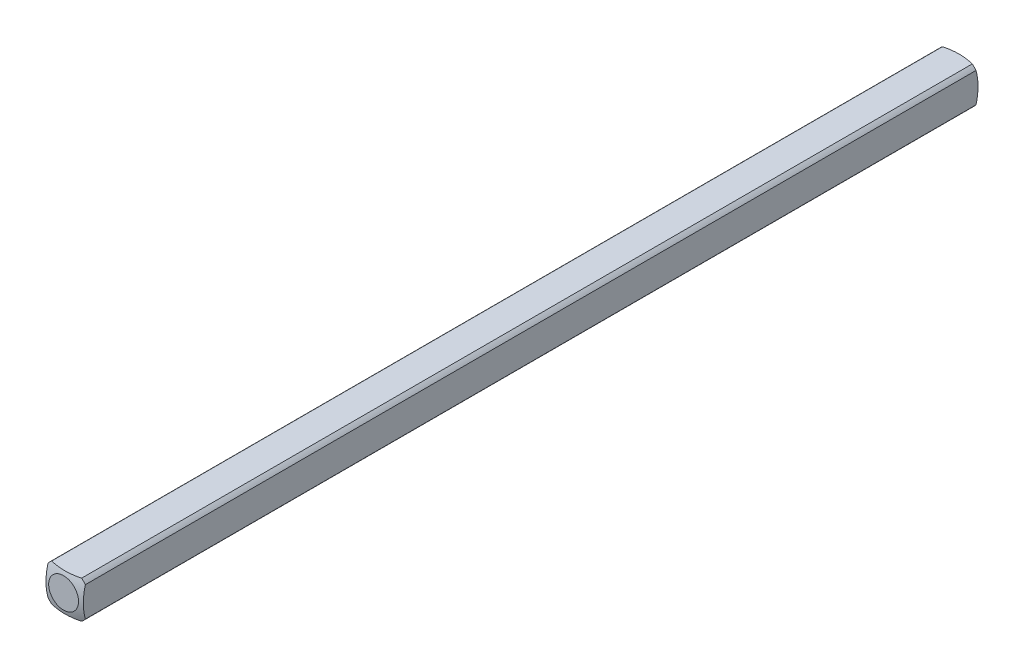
from build123d import *

# Parameters (mm, degrees)
SKETCH1_W           = 3.175
SKETCH1_H           = 3.175
BOSS_EXTRUDE1_DEPTH = 38.1
SKETCH2_OUTSIDE_W   = 12.848
SKETCH2_OUTSIDE_H   = 12.847
SKETCH2_OUTSIDE_R   = 2.032
CUT_EXTRUDE1_DEPTH  = 39.166088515


with BuildPart() as part:
    # Sketch1 → Boss-Extrude1 (new body)
    with BuildSketch(Plane.XY):
        Rectangle(SKETCH1_W, SKETCH1_H)
    extrude(amount=BOSS_EXTRUDE1_DEPTH)

    # Sketch2 outside → Cut-Extrude1 (cut, through all)
    with BuildSketch(Plane(origin=(0, 0, 0), x_dir=(-1, 0, 0), z_dir=(0, 0, -1))):
        with Locations((0, -0.0005)):
            Rectangle(SKETCH2_OUTSIDE_W, SKETCH2_OUTSIDE_H)
        Circle(SKETCH2_OUTSIDE_R, mode=Mode.SUBTRACT)
    extrude(amount=-CUT_EXTRUDE1_DEPTH, mode=Mode.SUBTRACT)

    # Sketch3 → Cut-Revolve1 (revolve, cut)
    with BuildSketch(Plane(origin=(0, 0, 0), x_dir=(1, 0, 0), z_dir=(0, 1, 0))):
        with BuildLine():
            Line((-5.053685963, -4.40273269), (-5.053685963, 5.740530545))
            Line((-5.053685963, 5.740530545), (0, 5.740530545))
            Line((0, 5.740530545), (0, 0.160877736))
            ThreePointArc((0, 0.160877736), (-3.404639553, -1.148866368), (-5.053685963, -4.40273269))
        make_face()
    revolve(axis=Axis((0, 0, 38.1), (0, 0, -1)), mode=Mode.SUBTRACT)

    # Mirror1: part across plane


with BuildPart() as part_1:
    add(part.part)
    add(part.part.mirror(Plane(origin=(0, 0, 38.1), x_dir=(1, 0, 0), z_dir=(0, 0, -1))))


solid = part_1.part
